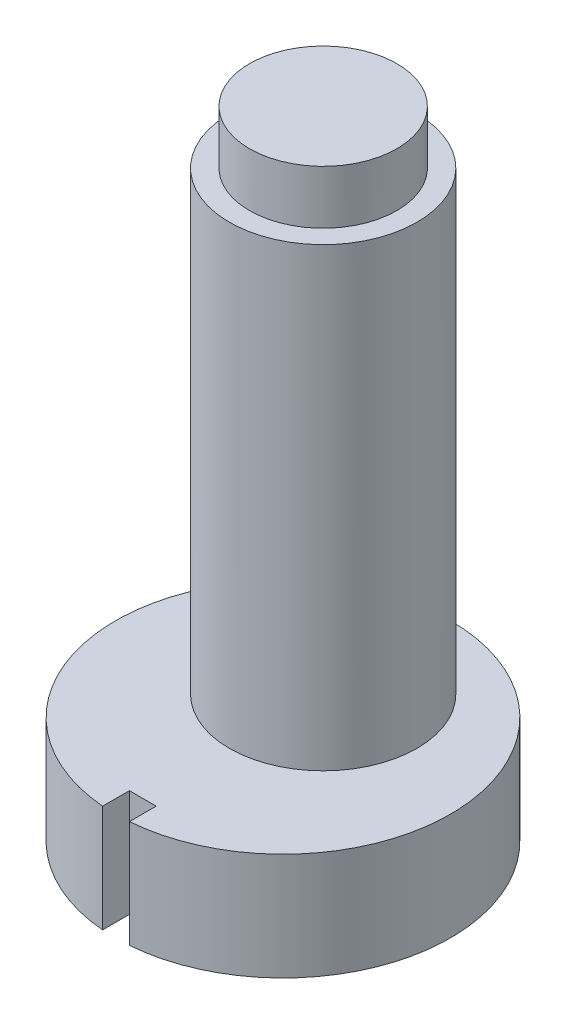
from build123d import *

# Parameters (mm, degrees)
SKETCH1_R           = 6.25
BOSS_EXTRUDE1_DEPTH = 4
SKETCH3_R           = 3.5
BOSS_EXTRUDE2_DEPTH = 17
SKETCH6_R           = 2.75
BOSS_EXTRUDE4_DEPTH = 2
CUT_EXTRUDE1_REACH  = 22.955
CUT_EXTRUDE2_START  = -10
CUT_EXTRUDE2_DEPTH  = 10


with BuildPart() as part:
    # Sketch1 → Boss-Extrude1 (new body)
    with BuildSketch(Plane(origin=(0, 0, 0), x_dir=(1, 0, 0), z_dir=(0, 1, 0))):
        with Locations(Location((0, 0, 0), (0, 0, 270))):
            Circle(SKETCH1_R)
    extrude(amount=BOSS_EXTRUDE1_DEPTH)

    # Sketch3 → Boss-Extrude2 (add)
    with BuildSketch(Plane(origin=(0, 4, 0), x_dir=(1, 0, 0), z_dir=(0, 1, 0))):
        with Locations(Location((0, 1.5, 0), (0, 0, 270))):
            Circle(SKETCH3_R)
    extrude(amount=BOSS_EXTRUDE2_DEPTH)

    # Sketch6 → Boss-Extrude4 (add)
    with BuildSketch(Plane(origin=(0, 21, 0), x_dir=(1, 0, 0), z_dir=(0, 1, 0))):
        with Locations(Location((0, 1.5, 0), (0, 0, 270))):
            Circle(SKETCH6_R)
    extrude(amount=BOSS_EXTRUDE4_DEPTH)

    # Sketch7 → Cut-Extrude1 (cut, up to next)
    with BuildSketch(Plane(origin=(0, 4, 0), x_dir=(1, 0, 0), z_dir=(0, 1, 0)), mode=Mode.PRIVATE) as cut_extrude1_sk1:
        with BuildLine():
            Line((-0.5, -6.229967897), (-0.5, -5.229967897))
            Line((-0.5, -5.229967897), (0.5, -5.229967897))
            Line((0.5, -5.229967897), (0.5, -6.229967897))
            ThreePointArc((0.5, -6.229967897), (0, -6.25), (-0.5, -6.229967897))
        make_face()
    cut_extrude1_tool1 = extrude(cut_extrude1_sk1.sketch, amount=-CUT_EXTRUDE1_REACH, mode=Mode.PRIVATE) & part.part
    add(cut_extrude1_tool1.solids().sort_by_distance((0, 4, 5.736665))[0], mode=Mode.SUBTRACT)

    # Sketch8 → Cut-Extrude2 (cut)
    with BuildSketch(Plane(origin=(0, 21, 0), x_dir=(1, 0, 0), z_dir=(0, 1, 0)).offset(CUT_EXTRUDE2_START)):
        with BuildLine():
            Line((-3.492200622, 1.733526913), (-2.512835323, 2.617210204))
            Line((-2.512835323, 2.617210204), (-2.512835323, 3.936320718))
            ThreePointArc((-2.512835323, 3.936320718), (-3.198154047, 2.921903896), (-3.492200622, 1.733526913))
        make_face()
    extrude(amount=CUT_EXTRUDE2_DEPTH, mode=Mode.SUBTRACT)


solid = part.part
